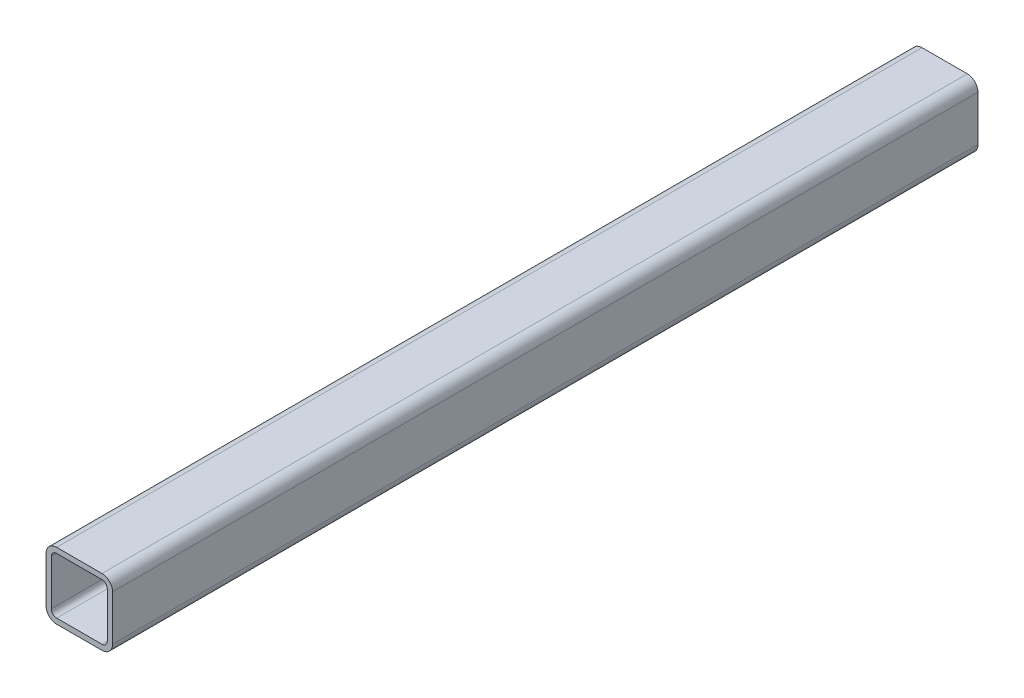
ISO-10303-21;
HEADER;
FILE_DESCRIPTION(('STEP AP214'),'2;1');
FILE_NAME('part.step','',(''),(''),'','','');
FILE_SCHEMA(('AUTOMOTIVE_DESIGN { 1 0 10303 214 1 1 1 1 }'));
ENDSEC;
DATA;
#1=APPLICATION_CONTEXT('core data for automotive mechanical design processes');
#2=APPLICATION_PROTOCOL_DEFINITION('international standard','automotive_design',2000,#1);
#3=PRODUCT_CONTEXT('',#1,'mechanical');
#4=PRODUCT('Part','Part','',(#3));
#5=PRODUCT_RELATED_PRODUCT_CATEGORY('part','',(#4));
#6=PRODUCT_DEFINITION_FORMATION('','',#4);
#7=PRODUCT_DEFINITION_CONTEXT('part definition',#1,'design');
#8=PRODUCT_DEFINITION('design','',#6,#7);
#9=PRODUCT_DEFINITION_SHAPE('','',#8);
#10=(LENGTH_UNIT() NAMED_UNIT(*) SI_UNIT(.MILLI.,.METRE.));
#11=(NAMED_UNIT(*) PLANE_ANGLE_UNIT() SI_UNIT($,.RADIAN.));
#12=(NAMED_UNIT(*) SI_UNIT($,.STERADIAN.) SOLID_ANGLE_UNIT());
#13=UNCERTAINTY_MEASURE_WITH_UNIT(LENGTH_MEASURE(1.E-05),#10,'distance_accuracy_value','');
#14=(GEOMETRIC_REPRESENTATION_CONTEXT(3) GLOBAL_UNCERTAINTY_ASSIGNED_CONTEXT((#13)) GLOBAL_UNIT_ASSIGNED_CONTEXT((#10,
#11,#12)) REPRESENTATION_CONTEXT('',''));
#15=CARTESIAN_POINT('',(0.,0.,0.));
#16=DIRECTION('',(0.,0.,1.));
#17=DIRECTION('',(1.,0.,0.));
#18=AXIS2_PLACEMENT_3D('',#15,#16,#17);
#19=CARTESIAN_POINT('',(-12.97432,12.97432,247.65));
#20=DIRECTION('',(0.,0.,1.));
#21=DIRECTION('',(1.,0.,0.));
#22=AXIS2_PLACEMENT_3D('',#19,#20,#21);
#23=PLANE('',#22);
#24=CARTESIAN_POINT('',(-12.97432,12.97432,247.65));
#25=DIRECTION('',(0.,0.,1.));
#26=DIRECTION('',(-1.,0.,0.));
#27=AXIS2_PLACEMENT_3D('',#24,#25,#26);
#28=CIRCLE('',#27,6.07568);
#29=CARTESIAN_POINT('',(-12.97432,19.05,247.65));
#30=VERTEX_POINT('',#29);
#31=CARTESIAN_POINT('',(-19.05,12.97432,247.65));
#32=VERTEX_POINT('',#31);
#33=EDGE_CURVE('E260',#30,#32,#28,.T.);
#34=ORIENTED_EDGE('',*,*,#33,.T.);
#35=DIRECTION('',(0.,-1.,0.));
#36=VECTOR('',#35,1.);
#37=CARTESIAN_POINT('',(-19.05,12.97432,247.65));
#38=LINE('',#37,#36);
#39=CARTESIAN_POINT('',(-19.05,-12.97432,247.65));
#40=VERTEX_POINT('',#39);
#41=EDGE_CURVE('E263',#32,#40,#38,.T.);
#42=ORIENTED_EDGE('',*,*,#41,.T.);
#43=CARTESIAN_POINT('',(-12.97432,-12.97432,247.65));
#44=DIRECTION('',(0.,0.,1.));
#45=DIRECTION('',(-1.,0.,0.));
#46=AXIS2_PLACEMENT_3D('',#43,#44,#45);
#47=CIRCLE('',#46,6.07568);
#48=CARTESIAN_POINT('',(-12.97432,-19.05,247.65));
#49=VERTEX_POINT('',#48);
#50=EDGE_CURVE('E266',#40,#49,#47,.T.);
#51=ORIENTED_EDGE('',*,*,#50,.T.);
#52=DIRECTION('',(1.,0.,0.));
#53=VECTOR('',#52,1.);
#54=CARTESIAN_POINT('',(-12.97432,-19.05,247.65));
#55=LINE('',#54,#53);
#56=CARTESIAN_POINT('',(12.97432,-19.05,247.65));
#57=VERTEX_POINT('',#56);
#58=EDGE_CURVE('E268',#49,#57,#55,.T.);
#59=ORIENTED_EDGE('',*,*,#58,.T.);
#60=CARTESIAN_POINT('',(12.97432,-12.97432,247.65));
#61=DIRECTION('',(0.,0.,1.));
#62=DIRECTION('',(1.,0.,0.));
#63=AXIS2_PLACEMENT_3D('',#60,#61,#62);
#64=CIRCLE('',#63,6.07568);
#65=CARTESIAN_POINT('',(19.05,-12.97432,247.65));
#66=VERTEX_POINT('',#65);
#67=EDGE_CURVE('E270',#57,#66,#64,.T.);
#68=ORIENTED_EDGE('',*,*,#67,.T.);
#69=DIRECTION('',(0.,1.,0.));
#70=VECTOR('',#69,1.);
#71=CARTESIAN_POINT('',(19.05,12.97432,247.65));
#72=LINE('',#71,#70);
#73=CARTESIAN_POINT('',(19.05,12.97432,247.65));
#74=VERTEX_POINT('',#73);
#75=EDGE_CURVE('E272',#66,#74,#72,.T.);
#76=ORIENTED_EDGE('',*,*,#75,.T.);
#77=CARTESIAN_POINT('',(12.97432,12.97432,247.65));
#78=DIRECTION('',(0.,0.,1.));
#79=DIRECTION('',(1.,0.,0.));
#80=AXIS2_PLACEMENT_3D('',#77,#78,#79);
#81=CIRCLE('',#80,6.07568);
#82=CARTESIAN_POINT('',(12.97432,19.05,247.65));
#83=VERTEX_POINT('',#82);
#84=EDGE_CURVE('E274',#74,#83,#81,.T.);
#85=ORIENTED_EDGE('',*,*,#84,.T.);
#86=DIRECTION('',(-1.,0.,0.));
#87=VECTOR('',#86,1.);
#88=CARTESIAN_POINT('',(-12.97432,19.05,247.65));
#89=LINE('',#88,#87);
#90=EDGE_CURVE('E276',#83,#30,#89,.T.);
#91=ORIENTED_EDGE('',*,*,#90,.T.);
#92=EDGE_LOOP('',(#34,#42,#51,#59,#68,#76,#85,#91));
#93=FACE_BOUND('',#92,.T.);
#94=DIRECTION('',(0.,-1.,0.));
#95=VECTOR('',#94,1.);
#96=CARTESIAN_POINT('',(-16.01216,12.97432,247.65));
#97=LINE('',#96,#95);
#98=CARTESIAN_POINT('',(-16.01216,12.97432,247.65));
#99=VERTEX_POINT('',#98);
#100=CARTESIAN_POINT('',(-16.01216,-12.97432,247.65));
#101=VERTEX_POINT('',#100);
#102=EDGE_CURVE('E203',#99,#101,#97,.T.);
#103=ORIENTED_EDGE('',*,*,#102,.F.);
#104=CARTESIAN_POINT('',(-12.97432,12.97432,247.65));
#105=DIRECTION('',(0.,0.,-1.));
#106=DIRECTION('',(-1.,0.,0.));
#107=AXIS2_PLACEMENT_3D('',#104,#105,#106);
#108=CIRCLE('',#107,3.03784);
#109=CARTESIAN_POINT('',(-12.97432,16.01216,247.65));
#110=VERTEX_POINT('',#109);
#111=EDGE_CURVE('E195',#110,#99,#108,.F.);
#112=ORIENTED_EDGE('',*,*,#111,.F.);
#113=DIRECTION('',(-1.,0.,0.));
#114=VECTOR('',#113,1.);
#115=CARTESIAN_POINT('',(-12.97432,16.01216,247.65));
#116=LINE('',#115,#114);
#117=CARTESIAN_POINT('',(12.97432,16.01216,247.65));
#118=VERTEX_POINT('',#117);
#119=EDGE_CURVE('E228',#118,#110,#116,.T.);
#120=ORIENTED_EDGE('',*,*,#119,.F.);
#121=CARTESIAN_POINT('',(12.97432,12.97432,247.65));
#122=DIRECTION('',(0.,0.,-1.));
#123=DIRECTION('',(-1.,0.,0.));
#124=AXIS2_PLACEMENT_3D('',#121,#122,#123);
#125=CIRCLE('',#124,3.03784);
#126=CARTESIAN_POINT('',(16.01216,12.97432,247.65));
#127=VERTEX_POINT('',#126);
#128=EDGE_CURVE('E226',#127,#118,#125,.F.);
#129=ORIENTED_EDGE('',*,*,#128,.F.);
#130=DIRECTION('',(0.,1.,0.));
#131=VECTOR('',#130,1.);
#132=CARTESIAN_POINT('',(16.01216,12.97432,247.65));
#133=LINE('',#132,#131);
#134=CARTESIAN_POINT('',(16.01216,-12.97432,247.65));
#135=VERTEX_POINT('',#134);
#136=EDGE_CURVE('E224',#135,#127,#133,.T.);
#137=ORIENTED_EDGE('',*,*,#136,.F.);
#138=CARTESIAN_POINT('',(12.97432,-12.97432,247.65));
#139=DIRECTION('',(0.,0.,-1.));
#140=DIRECTION('',(-1.,0.,0.));
#141=AXIS2_PLACEMENT_3D('',#138,#139,#140);
#142=CIRCLE('',#141,3.03784);
#143=CARTESIAN_POINT('',(12.97432,-16.01216,247.65));
#144=VERTEX_POINT('',#143);
#145=EDGE_CURVE('E222',#144,#135,#142,.F.);
#146=ORIENTED_EDGE('',*,*,#145,.F.);
#147=DIRECTION('',(1.,0.,0.));
#148=VECTOR('',#147,1.);
#149=CARTESIAN_POINT('',(-12.97432,-16.01216,247.65));
#150=LINE('',#149,#148);
#151=CARTESIAN_POINT('',(-12.97432,-16.01216,247.65));
#152=VERTEX_POINT('',#151);
#153=EDGE_CURVE('E218',#152,#144,#150,.T.);
#154=ORIENTED_EDGE('',*,*,#153,.F.);
#155=CARTESIAN_POINT('',(-12.97432,-12.97432,247.65));
#156=DIRECTION('',(0.,0.,-1.));
#157=DIRECTION('',(-1.,0.,0.));
#158=AXIS2_PLACEMENT_3D('',#155,#156,#157);
#159=CIRCLE('',#158,3.03784);
#160=EDGE_CURVE('E216',#101,#152,#159,.F.);
#161=ORIENTED_EDGE('',*,*,#160,.F.);
#162=EDGE_LOOP('',(#103,#112,#120,#129,#137,#146,#154,#161));
#163=FACE_BOUND('',#162,.T.);
#164=ADVANCED_FACE('F82',(#93,#163),#23,.T.);
#165=CARTESIAN_POINT('',(-12.97432,12.97432,-247.65));
#166=DIRECTION('',(0.,0.,1.));
#167=DIRECTION('',(1.,0.,0.));
#168=AXIS2_PLACEMENT_3D('',#165,#166,#167);
#169=PLANE('',#168);
#170=CARTESIAN_POINT('',(-12.97432,12.97432,-247.65));
#171=DIRECTION('',(0.,0.,1.));
#172=DIRECTION('',(-1.,0.,0.));
#173=AXIS2_PLACEMENT_3D('',#170,#171,#172);
#174=CIRCLE('',#173,6.07568);
#175=CARTESIAN_POINT('',(-12.97432,19.05,-247.65));
#176=VERTEX_POINT('',#175);
#177=CARTESIAN_POINT('',(-19.05,12.97432,-247.65));
#178=VERTEX_POINT('',#177);
#179=EDGE_CURVE('E211',#176,#178,#174,.T.);
#180=ORIENTED_EDGE('',*,*,#179,.F.);
#181=DIRECTION('',(-1.,0.,0.));
#182=VECTOR('',#181,1.);
#183=CARTESIAN_POINT('',(-12.97432,19.05,-247.65));
#184=LINE('',#183,#182);
#185=CARTESIAN_POINT('',(12.97432,19.05,-247.65));
#186=VERTEX_POINT('',#185);
#187=EDGE_CURVE('E264',#186,#176,#184,.T.);
#188=ORIENTED_EDGE('',*,*,#187,.F.);
#189=CARTESIAN_POINT('',(12.97432,12.97432,-247.65));
#190=DIRECTION('',(0.,0.,1.));
#191=DIRECTION('',(1.,0.,0.));
#192=AXIS2_PLACEMENT_3D('',#189,#190,#191);
#193=CIRCLE('',#192,6.07568);
#194=CARTESIAN_POINT('',(19.05,12.97432,-247.65));
#195=VERTEX_POINT('',#194);
#196=EDGE_CURVE('E291',#195,#186,#193,.T.);
#197=ORIENTED_EDGE('',*,*,#196,.F.);
#198=DIRECTION('',(0.,1.,0.));
#199=VECTOR('',#198,1.);
#200=CARTESIAN_POINT('',(19.05,12.97432,-247.65));
#201=LINE('',#200,#199);
#202=CARTESIAN_POINT('',(19.05,-12.97432,-247.65));
#203=VERTEX_POINT('',#202);
#204=EDGE_CURVE('E289',#203,#195,#201,.T.);
#205=ORIENTED_EDGE('',*,*,#204,.F.);
#206=CARTESIAN_POINT('',(12.97432,-12.97432,-247.65));
#207=DIRECTION('',(0.,0.,1.));
#208=DIRECTION('',(1.,0.,0.));
#209=AXIS2_PLACEMENT_3D('',#206,#207,#208);
#210=CIRCLE('',#209,6.07568);
#211=CARTESIAN_POINT('',(12.97432,-19.05,-247.65));
#212=VERTEX_POINT('',#211);
#213=EDGE_CURVE('E287',#212,#203,#210,.T.);
#214=ORIENTED_EDGE('',*,*,#213,.F.);
#215=DIRECTION('',(1.,0.,0.));
#216=VECTOR('',#215,1.);
#217=CARTESIAN_POINT('',(-12.97432,-19.05,-247.65));
#218=LINE('',#217,#216);
#219=CARTESIAN_POINT('',(-12.97432,-19.05,-247.65));
#220=VERTEX_POINT('',#219);
#221=EDGE_CURVE('E285',#220,#212,#218,.T.);
#222=ORIENTED_EDGE('',*,*,#221,.F.);
#223=CARTESIAN_POINT('',(-12.97432,-12.97432,-247.65));
#224=DIRECTION('',(0.,0.,1.));
#225=DIRECTION('',(-1.,0.,0.));
#226=AXIS2_PLACEMENT_3D('',#223,#224,#225);
#227=CIRCLE('',#226,6.07568);
#228=CARTESIAN_POINT('',(-19.05,-12.97432,-247.65));
#229=VERTEX_POINT('',#228);
#230=EDGE_CURVE('E283',#229,#220,#227,.T.);
#231=ORIENTED_EDGE('',*,*,#230,.F.);
#232=DIRECTION('',(0.,-1.,0.));
#233=VECTOR('',#232,1.);
#234=CARTESIAN_POINT('',(-19.05,12.97432,-247.65));
#235=LINE('',#234,#233);
#236=EDGE_CURVE('E281',#178,#229,#235,.T.);
#237=ORIENTED_EDGE('',*,*,#236,.F.);
#238=EDGE_LOOP('',(#180,#188,#197,#205,#214,#222,#231,#237));
#239=FACE_BOUND('',#238,.T.);
#240=CARTESIAN_POINT('',(-12.97432,12.97432,-247.65));
#241=DIRECTION('',(0.,0.,-1.));
#242=DIRECTION('',(-1.,0.,0.));
#243=AXIS2_PLACEMENT_3D('',#240,#241,#242);
#244=CIRCLE('',#243,3.03784);
#245=CARTESIAN_POINT('',(-12.97432,16.01216,-247.65));
#246=VERTEX_POINT('',#245);
#247=CARTESIAN_POINT('',(-16.01216,12.97432,-247.65));
#248=VERTEX_POINT('',#247);
#249=EDGE_CURVE('E105',#246,#248,#244,.F.);
#250=ORIENTED_EDGE('',*,*,#249,.T.);
#251=DIRECTION('',(0.,-1.,0.));
#252=VECTOR('',#251,1.);
#253=CARTESIAN_POINT('',(-16.01216,12.97432,-247.65));
#254=LINE('',#253,#252);
#255=CARTESIAN_POINT('',(-16.01216,-12.97432,-247.65));
#256=VERTEX_POINT('',#255);
#257=EDGE_CURVE('E210',#248,#256,#254,.T.);
#258=ORIENTED_EDGE('',*,*,#257,.T.);
#259=CARTESIAN_POINT('',(-12.97432,-12.97432,-247.65));
#260=DIRECTION('',(0.,0.,-1.));
#261=DIRECTION('',(-1.,0.,0.));
#262=AXIS2_PLACEMENT_3D('',#259,#260,#261);
#263=CIRCLE('',#262,3.03784);
#264=CARTESIAN_POINT('',(-12.97432,-16.01216,-247.65));
#265=VERTEX_POINT('',#264);
#266=EDGE_CURVE('E232',#256,#265,#263,.F.);
#267=ORIENTED_EDGE('',*,*,#266,.T.);
#268=DIRECTION('',(1.,0.,0.));
#269=VECTOR('',#268,1.);
#270=CARTESIAN_POINT('',(-12.97432,-16.01216,-247.65));
#271=LINE('',#270,#269);
#272=CARTESIAN_POINT('',(12.97432,-16.01216,-247.65));
#273=VERTEX_POINT('',#272);
#274=EDGE_CURVE('E235',#265,#273,#271,.T.);
#275=ORIENTED_EDGE('',*,*,#274,.T.);
#276=CARTESIAN_POINT('',(12.97432,-12.97432,-247.65));
#277=DIRECTION('',(0.,0.,-1.));
#278=DIRECTION('',(-1.,0.,0.));
#279=AXIS2_PLACEMENT_3D('',#276,#277,#278);
#280=CIRCLE('',#279,3.03784);
#281=CARTESIAN_POINT('',(16.01216,-12.97432,-247.65));
#282=VERTEX_POINT('',#281);
#283=EDGE_CURVE('E238',#273,#282,#280,.F.);
#284=ORIENTED_EDGE('',*,*,#283,.T.);
#285=DIRECTION('',(0.,1.,0.));
#286=VECTOR('',#285,1.);
#287=CARTESIAN_POINT('',(16.01216,12.97432,-247.65));
#288=LINE('',#287,#286);
#289=CARTESIAN_POINT('',(16.01216,12.97432,-247.65));
#290=VERTEX_POINT('',#289);
#291=EDGE_CURVE('E241',#282,#290,#288,.T.);
#292=ORIENTED_EDGE('',*,*,#291,.T.);
#293=CARTESIAN_POINT('',(12.97432,12.97432,-247.65));
#294=DIRECTION('',(0.,0.,-1.));
#295=DIRECTION('',(-1.,0.,0.));
#296=AXIS2_PLACEMENT_3D('',#293,#294,#295);
#297=CIRCLE('',#296,3.03784);
#298=CARTESIAN_POINT('',(12.97432,16.01216,-247.65));
#299=VERTEX_POINT('',#298);
#300=EDGE_CURVE('E244',#290,#299,#297,.F.);
#301=ORIENTED_EDGE('',*,*,#300,.T.);
#302=DIRECTION('',(-1.,0.,0.));
#303=VECTOR('',#302,1.);
#304=CARTESIAN_POINT('',(-12.97432,16.01216,-247.65));
#305=LINE('',#304,#303);
#306=EDGE_CURVE('E204',#299,#246,#305,.T.);
#307=ORIENTED_EDGE('',*,*,#306,.T.);
#308=EDGE_LOOP('',(#250,#258,#267,#275,#284,#292,#301,#307));
#309=FACE_BOUND('',#308,.T.);
#310=ADVANCED_FACE('F321',(#239,#309),#169,.F.);
#311=CARTESIAN_POINT('',(-12.97432,12.97432,247.65));
#312=DIRECTION('',(0.,0.,-1.));
#313=DIRECTION('',(-1.,0.,0.));
#314=AXIS2_PLACEMENT_3D('',#311,#312,#313);
#315=CYLINDRICAL_SURFACE('',#314,6.07568);
#316=ORIENTED_EDGE('',*,*,#179,.T.);
#317=DIRECTION('',(0.,0.,-1.));
#318=VECTOR('',#317,1.);
#319=CARTESIAN_POINT('',(-19.05,12.97432,247.65));
#320=LINE('',#319,#318);
#321=EDGE_CURVE('E12',#32,#178,#320,.T.);
#322=ORIENTED_EDGE('',*,*,#321,.F.);
#323=ORIENTED_EDGE('',*,*,#33,.F.);
#324=DIRECTION('',(0.,0.,-1.));
#325=VECTOR('',#324,1.);
#326=CARTESIAN_POINT('',(-12.97432,19.05,247.65));
#327=LINE('',#326,#325);
#328=EDGE_CURVE('E278',#30,#176,#327,.T.);
#329=ORIENTED_EDGE('',*,*,#328,.T.);
#330=EDGE_LOOP('',(#316,#322,#323,#329));
#331=FACE_BOUND('',#330,.T.);
#332=ADVANCED_FACE('F84',(#331),#315,.T.);
#333=CARTESIAN_POINT('',(-19.05,12.97432,247.65));
#334=DIRECTION('',(1.,0.,0.));
#335=DIRECTION('',(0.,1.,0.));
#336=AXIS2_PLACEMENT_3D('',#333,#334,#335);
#337=PLANE('',#336);
#338=ORIENTED_EDGE('',*,*,#236,.T.);
#339=DIRECTION('',(0.,0.,-1.));
#340=VECTOR('',#339,1.);
#341=CARTESIAN_POINT('',(-19.05,-12.97432,247.65));
#342=LINE('',#341,#340);
#343=EDGE_CURVE('E90',#40,#229,#342,.T.);
#344=ORIENTED_EDGE('',*,*,#343,.F.);
#345=ORIENTED_EDGE('',*,*,#41,.F.);
#346=ORIENTED_EDGE('',*,*,#321,.T.);
#347=EDGE_LOOP('',(#338,#344,#345,#346));
#348=FACE_BOUND('',#347,.T.);
#349=ADVANCED_FACE('F338',(#348),#337,.F.);
#350=CARTESIAN_POINT('',(-12.97432,-12.97432,247.65));
#351=DIRECTION('',(0.,0.,-1.));
#352=DIRECTION('',(-1.,0.,0.));
#353=AXIS2_PLACEMENT_3D('',#350,#351,#352);
#354=CYLINDRICAL_SURFACE('',#353,6.07568);
#355=ORIENTED_EDGE('',*,*,#230,.T.);
#356=DIRECTION('',(0.,0.,-1.));
#357=VECTOR('',#356,1.);
#358=CARTESIAN_POINT('',(-12.97432,-19.05,247.65));
#359=LINE('',#358,#357);
#360=EDGE_CURVE('E308',#49,#220,#359,.T.);
#361=ORIENTED_EDGE('',*,*,#360,.F.);
#362=ORIENTED_EDGE('',*,*,#50,.F.);
#363=ORIENTED_EDGE('',*,*,#343,.T.);
#364=EDGE_LOOP('',(#355,#361,#362,#363));
#365=FACE_BOUND('',#364,.T.);
#366=ADVANCED_FACE('F315',(#365),#354,.T.);
#367=CARTESIAN_POINT('',(-12.97432,-19.05,247.65));
#368=DIRECTION('',(0.,1.,0.));
#369=DIRECTION('',(0.,0.,1.));
#370=AXIS2_PLACEMENT_3D('',#367,#368,#369);
#371=PLANE('',#370);
#372=ORIENTED_EDGE('',*,*,#221,.T.);
#373=DIRECTION('',(0.,0.,-1.));
#374=VECTOR('',#373,1.);
#375=CARTESIAN_POINT('',(12.97432,-19.05,247.65));
#376=LINE('',#375,#374);
#377=EDGE_CURVE('E305',#57,#212,#376,.T.);
#378=ORIENTED_EDGE('',*,*,#377,.F.);
#379=ORIENTED_EDGE('',*,*,#58,.F.);
#380=ORIENTED_EDGE('',*,*,#360,.T.);
#381=EDGE_LOOP('',(#372,#378,#379,#380));
#382=FACE_BOUND('',#381,.T.);
#383=ADVANCED_FACE('F327',(#382),#371,.F.);
#384=CARTESIAN_POINT('',(12.97432,-12.97432,247.65));
#385=DIRECTION('',(0.,0.,-1.));
#386=DIRECTION('',(-1.,0.,0.));
#387=AXIS2_PLACEMENT_3D('',#384,#385,#386);
#388=CYLINDRICAL_SURFACE('',#387,6.07568);
#389=ORIENTED_EDGE('',*,*,#213,.T.);
#390=DIRECTION('',(0.,0.,-1.));
#391=VECTOR('',#390,1.);
#392=CARTESIAN_POINT('',(19.05,-12.97432,247.65));
#393=LINE('',#392,#391);
#394=EDGE_CURVE('E302',#66,#203,#393,.T.);
#395=ORIENTED_EDGE('',*,*,#394,.F.);
#396=ORIENTED_EDGE('',*,*,#67,.F.);
#397=ORIENTED_EDGE('',*,*,#377,.T.);
#398=EDGE_LOOP('',(#389,#395,#396,#397));
#399=FACE_BOUND('',#398,.T.);
#400=ADVANCED_FACE('F331',(#399),#388,.T.);
#401=CARTESIAN_POINT('',(19.05,12.97432,247.65));
#402=DIRECTION('',(-1.,0.,0.));
#403=DIRECTION('',(0.,-1.,0.));
#404=AXIS2_PLACEMENT_3D('',#401,#402,#403);
#405=PLANE('',#404);
#406=ORIENTED_EDGE('',*,*,#204,.T.);
#407=DIRECTION('',(0.,0.,-1.));
#408=VECTOR('',#407,1.);
#409=CARTESIAN_POINT('',(19.05,12.97432,247.65));
#410=LINE('',#409,#408);
#411=EDGE_CURVE('E299',#74,#195,#410,.T.);
#412=ORIENTED_EDGE('',*,*,#411,.F.);
#413=ORIENTED_EDGE('',*,*,#75,.F.);
#414=ORIENTED_EDGE('',*,*,#394,.T.);
#415=EDGE_LOOP('',(#406,#412,#413,#414));
#416=FACE_BOUND('',#415,.T.);
#417=ADVANCED_FACE('F351',(#416),#405,.F.);
#418=CARTESIAN_POINT('',(12.97432,12.97432,247.65));
#419=DIRECTION('',(0.,0.,-1.));
#420=DIRECTION('',(-1.,0.,0.));
#421=AXIS2_PLACEMENT_3D('',#418,#419,#420);
#422=CYLINDRICAL_SURFACE('',#421,6.07568);
#423=ORIENTED_EDGE('',*,*,#196,.T.);
#424=DIRECTION('',(0.,0.,-1.));
#425=VECTOR('',#424,1.);
#426=CARTESIAN_POINT('',(12.97432,19.05,247.65));
#427=LINE('',#426,#425);
#428=EDGE_CURVE('E296',#83,#186,#427,.T.);
#429=ORIENTED_EDGE('',*,*,#428,.F.);
#430=ORIENTED_EDGE('',*,*,#84,.F.);
#431=ORIENTED_EDGE('',*,*,#411,.T.);
#432=EDGE_LOOP('',(#423,#429,#430,#431));
#433=FACE_BOUND('',#432,.T.);
#434=ADVANCED_FACE('F349',(#433),#422,.T.);
#435=CARTESIAN_POINT('',(-12.97432,19.05,247.65));
#436=DIRECTION('',(0.,-1.,0.));
#437=DIRECTION('',(0.,0.,-1.));
#438=AXIS2_PLACEMENT_3D('',#435,#436,#437);
#439=PLANE('',#438);
#440=ORIENTED_EDGE('',*,*,#187,.T.);
#441=ORIENTED_EDGE('',*,*,#328,.F.);
#442=ORIENTED_EDGE('',*,*,#90,.F.);
#443=ORIENTED_EDGE('',*,*,#428,.T.);
#444=EDGE_LOOP('',(#440,#441,#442,#443));
#445=FACE_BOUND('',#444,.T.);
#446=ADVANCED_FACE('F344',(#445),#439,.F.);
#447=CARTESIAN_POINT('',(-12.97432,12.97432,247.65));
#448=DIRECTION('',(0.,0.,-1.));
#449=DIRECTION('',(-1.,0.,0.));
#450=AXIS2_PLACEMENT_3D('',#447,#448,#449);
#451=CYLINDRICAL_SURFACE('',#450,3.03784);
#452=ORIENTED_EDGE('',*,*,#249,.F.);
#453=DIRECTION('',(0.,0.,-1.));
#454=VECTOR('',#453,1.);
#455=CARTESIAN_POINT('',(-12.97432,16.01216,247.65));
#456=LINE('',#455,#454);
#457=EDGE_CURVE('E199',#110,#246,#456,.T.);
#458=ORIENTED_EDGE('',*,*,#457,.F.);
#459=ORIENTED_EDGE('',*,*,#111,.T.);
#460=DIRECTION('',(0.,0.,-1.));
#461=VECTOR('',#460,1.);
#462=CARTESIAN_POINT('',(-16.01216,12.97432,247.65));
#463=LINE('',#462,#461);
#464=EDGE_CURVE('E198',#99,#248,#463,.T.);
#465=ORIENTED_EDGE('',*,*,#464,.T.);
#466=EDGE_LOOP('',(#452,#458,#459,#465));
#467=FACE_BOUND('',#466,.T.);
#468=ADVANCED_FACE('F197',(#467),#451,.F.);
#469=CARTESIAN_POINT('',(-16.01216,12.97432,247.65));
#470=DIRECTION('',(1.,0.,0.));
#471=DIRECTION('',(0.,1.,0.));
#472=AXIS2_PLACEMENT_3D('',#469,#470,#471);
#473=PLANE('',#472);
#474=ORIENTED_EDGE('',*,*,#257,.F.);
#475=ORIENTED_EDGE('',*,*,#464,.F.);
#476=ORIENTED_EDGE('',*,*,#102,.T.);
#477=DIRECTION('',(0.,0.,-1.));
#478=VECTOR('',#477,1.);
#479=CARTESIAN_POINT('',(-16.01216,-12.97432,247.65));
#480=LINE('',#479,#478);
#481=EDGE_CURVE('E212',#101,#256,#480,.T.);
#482=ORIENTED_EDGE('',*,*,#481,.T.);
#483=EDGE_LOOP('',(#474,#475,#476,#482));
#484=FACE_BOUND('',#483,.T.);
#485=ADVANCED_FACE('F207',(#484),#473,.T.);
#486=CARTESIAN_POINT('',(-12.97432,-12.97432,247.65));
#487=DIRECTION('',(0.,0.,-1.));
#488=DIRECTION('',(-1.,0.,0.));
#489=AXIS2_PLACEMENT_3D('',#486,#487,#488);
#490=CYLINDRICAL_SURFACE('',#489,3.03784);
#491=ORIENTED_EDGE('',*,*,#266,.F.);
#492=ORIENTED_EDGE('',*,*,#481,.F.);
#493=ORIENTED_EDGE('',*,*,#160,.T.);
#494=DIRECTION('',(0.,0.,-1.));
#495=VECTOR('',#494,1.);
#496=CARTESIAN_POINT('',(-12.97432,-16.01216,247.65));
#497=LINE('',#496,#495);
#498=EDGE_CURVE('E257',#152,#265,#497,.T.);
#499=ORIENTED_EDGE('',*,*,#498,.T.);
#500=EDGE_LOOP('',(#491,#492,#493,#499));
#501=FACE_BOUND('',#500,.T.);
#502=ADVANCED_FACE('F376',(#501),#490,.F.);
#503=CARTESIAN_POINT('',(-12.97432,-16.01216,247.65));
#504=DIRECTION('',(0.,1.,0.));
#505=DIRECTION('',(0.,0.,1.));
#506=AXIS2_PLACEMENT_3D('',#503,#504,#505);
#507=PLANE('',#506);
#508=ORIENTED_EDGE('',*,*,#274,.F.);
#509=ORIENTED_EDGE('',*,*,#498,.F.);
#510=ORIENTED_EDGE('',*,*,#153,.T.);
#511=DIRECTION('',(0.,0.,-1.));
#512=VECTOR('',#511,1.);
#513=CARTESIAN_POINT('',(12.97432,-16.01216,247.65));
#514=LINE('',#513,#512);
#515=EDGE_CURVE('E255',#144,#273,#514,.T.);
#516=ORIENTED_EDGE('',*,*,#515,.T.);
#517=EDGE_LOOP('',(#508,#509,#510,#516));
#518=FACE_BOUND('',#517,.T.);
#519=ADVANCED_FACE('F380',(#518),#507,.T.);
#520=CARTESIAN_POINT('',(12.97432,-12.97432,247.65));
#521=DIRECTION('',(0.,0.,-1.));
#522=DIRECTION('',(-1.,0.,0.));
#523=AXIS2_PLACEMENT_3D('',#520,#521,#522);
#524=CYLINDRICAL_SURFACE('',#523,3.03784);
#525=ORIENTED_EDGE('',*,*,#283,.F.);
#526=ORIENTED_EDGE('',*,*,#515,.F.);
#527=ORIENTED_EDGE('',*,*,#145,.T.);
#528=DIRECTION('',(0.,0.,-1.));
#529=VECTOR('',#528,1.);
#530=CARTESIAN_POINT('',(16.01216,-12.97432,247.65));
#531=LINE('',#530,#529);
#532=EDGE_CURVE('E253',#135,#282,#531,.T.);
#533=ORIENTED_EDGE('',*,*,#532,.T.);
#534=EDGE_LOOP('',(#525,#526,#527,#533));
#535=FACE_BOUND('',#534,.T.);
#536=ADVANCED_FACE('F386',(#535),#524,.F.);
#537=CARTESIAN_POINT('',(16.01216,12.97432,247.65));
#538=DIRECTION('',(-1.,0.,0.));
#539=DIRECTION('',(0.,-1.,0.));
#540=AXIS2_PLACEMENT_3D('',#537,#538,#539);
#541=PLANE('',#540);
#542=ORIENTED_EDGE('',*,*,#291,.F.);
#543=ORIENTED_EDGE('',*,*,#532,.F.);
#544=ORIENTED_EDGE('',*,*,#136,.T.);
#545=DIRECTION('',(0.,0.,-1.));
#546=VECTOR('',#545,1.);
#547=CARTESIAN_POINT('',(16.01216,12.97432,247.65));
#548=LINE('',#547,#546);
#549=EDGE_CURVE('E251',#127,#290,#548,.T.);
#550=ORIENTED_EDGE('',*,*,#549,.T.);
#551=EDGE_LOOP('',(#542,#543,#544,#550));
#552=FACE_BOUND('',#551,.T.);
#553=ADVANCED_FACE('F390',(#552),#541,.T.);
#554=CARTESIAN_POINT('',(12.97432,12.97432,247.65));
#555=DIRECTION('',(0.,0.,-1.));
#556=DIRECTION('',(-1.,0.,0.));
#557=AXIS2_PLACEMENT_3D('',#554,#555,#556);
#558=CYLINDRICAL_SURFACE('',#557,3.03784);
#559=ORIENTED_EDGE('',*,*,#300,.F.);
#560=ORIENTED_EDGE('',*,*,#549,.F.);
#561=ORIENTED_EDGE('',*,*,#128,.T.);
#562=DIRECTION('',(0.,0.,-1.));
#563=VECTOR('',#562,1.);
#564=CARTESIAN_POINT('',(12.97432,16.01216,247.65));
#565=LINE('',#564,#563);
#566=EDGE_CURVE('E97',#118,#299,#565,.T.);
#567=ORIENTED_EDGE('',*,*,#566,.T.);
#568=EDGE_LOOP('',(#559,#560,#561,#567));
#569=FACE_BOUND('',#568,.T.);
#570=ADVANCED_FACE('F394',(#569),#558,.F.);
#571=CARTESIAN_POINT('',(-12.97432,16.01216,247.65));
#572=DIRECTION('',(0.,-1.,0.));
#573=DIRECTION('',(0.,0.,-1.));
#574=AXIS2_PLACEMENT_3D('',#571,#572,#573);
#575=PLANE('',#574);
#576=ORIENTED_EDGE('',*,*,#306,.F.);
#577=ORIENTED_EDGE('',*,*,#566,.F.);
#578=ORIENTED_EDGE('',*,*,#119,.T.);
#579=ORIENTED_EDGE('',*,*,#457,.T.);
#580=EDGE_LOOP('',(#576,#577,#578,#579));
#581=FACE_BOUND('',#580,.T.);
#582=ADVANCED_FACE('F398',(#581),#575,.T.);
#583=CLOSED_SHELL('',(#164,#310,#332,#349,#366,#383,#400,#417,#434,#446,#468,#485,#502,#519,
#536,#553,#570,#582));
#584=MANIFOLD_SOLID_BREP('B2',#583);
#585=ADVANCED_BREP_SHAPE_REPRESENTATION('',(#18,#584),#14);
#586=SHAPE_DEFINITION_REPRESENTATION(#9,#585);
ENDSEC;
END-ISO-10303-21;
